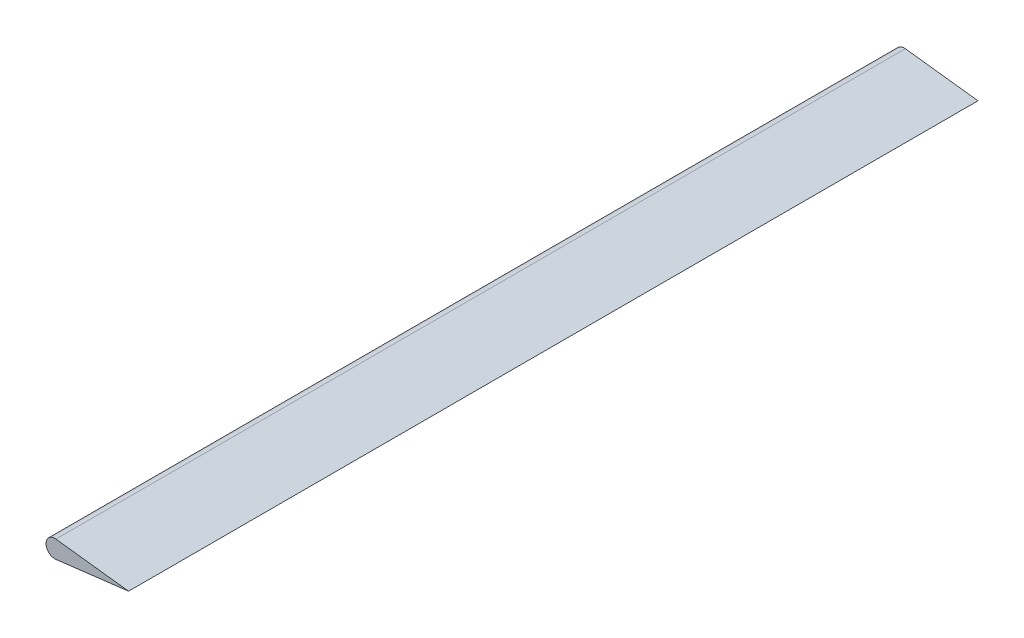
from build123d import *

# Parameters (mm, degrees)
BASE_EXTRUDE_DEPTH = 1828.8


with BuildPart() as part:
    # Sketch1 → Base-Extrude (new body)
    with BuildSketch(Plane.XY):
        with BuildLine():
            Line((2.286, 18.912342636), (158.75, 0))
            Line((158.75, 0), (2.286, -18.912342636))
            ThreePointArc((2.286, -18.912342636), (-19.05, 0), (2.286, 18.912342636))
        make_face()
    extrude(amount=BASE_EXTRUDE_DEPTH)


solid = part.part
